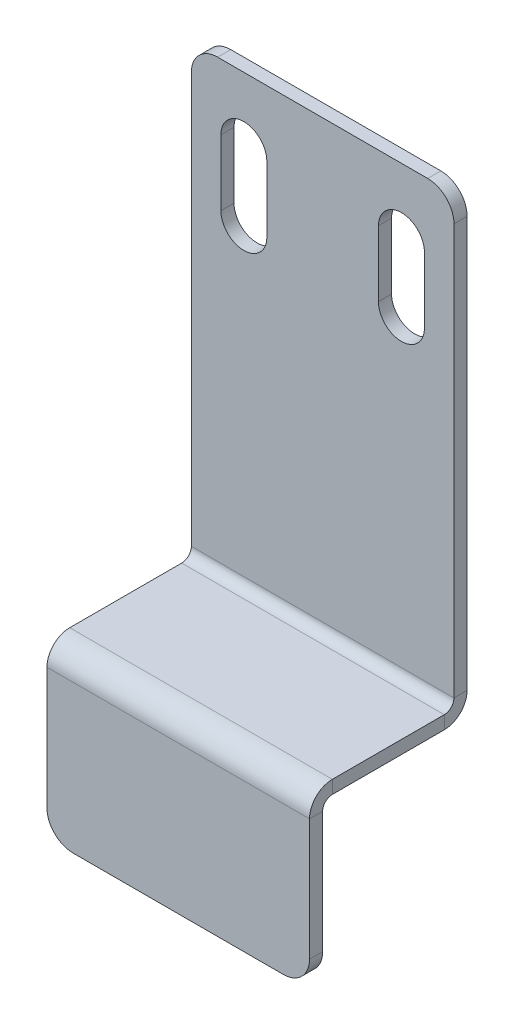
ISO-10303-21;
HEADER;
FILE_DESCRIPTION(('STEP AP214'),'2;1');
FILE_NAME('part.step','',(''),(''),'','','');
FILE_SCHEMA(('AUTOMOTIVE_DESIGN { 1 0 10303 214 1 1 1 1 }'));
ENDSEC;
DATA;
#1=APPLICATION_CONTEXT('core data for automotive mechanical design processes');
#2=APPLICATION_PROTOCOL_DEFINITION('international standard','automotive_design',2000,#1);
#3=PRODUCT_CONTEXT('',#1,'mechanical');
#4=PRODUCT('Part','Part','',(#3));
#5=PRODUCT_RELATED_PRODUCT_CATEGORY('part','',(#4));
#6=PRODUCT_DEFINITION_FORMATION('','',#4);
#7=PRODUCT_DEFINITION_CONTEXT('part definition',#1,'design');
#8=PRODUCT_DEFINITION('design','',#6,#7);
#9=PRODUCT_DEFINITION_SHAPE('','',#8);
#10=(LENGTH_UNIT() NAMED_UNIT(*) SI_UNIT(.MILLI.,.METRE.));
#11=(NAMED_UNIT(*) PLANE_ANGLE_UNIT() SI_UNIT($,.RADIAN.));
#12=(NAMED_UNIT(*) SI_UNIT($,.STERADIAN.) SOLID_ANGLE_UNIT());
#13=UNCERTAINTY_MEASURE_WITH_UNIT(LENGTH_MEASURE(1.E-05),#10,'distance_accuracy_value','');
#14=(GEOMETRIC_REPRESENTATION_CONTEXT(3) GLOBAL_UNCERTAINTY_ASSIGNED_CONTEXT((#13)) GLOBAL_UNIT_ASSIGNED_CONTEXT((#10,
#11,#12)) REPRESENTATION_CONTEXT('',''));
#15=CARTESIAN_POINT('',(0.,0.,0.));
#16=DIRECTION('',(0.,0.,1.));
#17=DIRECTION('',(1.,0.,0.));
#18=AXIS2_PLACEMENT_3D('',#15,#16,#17);
#19=CARTESIAN_POINT('',(20.,-35.,1.7366));
#20=DIRECTION('',(1.,0.,0.));
#21=DIRECTION('',(0.,0.,-1.));
#22=AXIS2_PLACEMENT_3D('',#19,#20,#21);
#23=PLANE('',#22);
#24=DIRECTION('',(0.,1.,0.));
#25=VECTOR('',#24,1.);
#26=CARTESIAN_POINT('',(20.,-35.,1.7366));
#27=LINE('',#26,#25);
#28=CARTESIAN_POINT('',(20.,-35.,1.7366));
#29=VERTEX_POINT('',#28);
#30=CARTESIAN_POINT('',(20.,-34.,1.7366));
#31=VERTEX_POINT('',#30);
#32=EDGE_CURVE('E374',#29,#31,#27,.T.);
#33=ORIENTED_EDGE('',*,*,#32,.F.);
#34=CARTESIAN_POINT('',(20.,-33.2634,1.7366));
#35=DIRECTION('',(1.,0.,0.));
#36=DIRECTION('',(0.,0.,-1.));
#37=AXIS2_PLACEMENT_3D('',#34,#35,#36);
#38=CIRCLE('',#37,1.7366);
#39=CARTESIAN_POINT('',(20.,-33.2634,0.));
#40=VERTEX_POINT('',#39);
#41=EDGE_CURVE('E280',#40,#29,#38,.F.);
#42=ORIENTED_EDGE('',*,*,#41,.F.);
#43=DIRECTION('',(0.,0.,-1.));
#44=VECTOR('',#43,1.);
#45=CARTESIAN_POINT('',(20.,-33.2634,0.999999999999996));
#46=LINE('',#45,#44);
#47=CARTESIAN_POINT('',(20.,-33.2634,0.999999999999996));
#48=VERTEX_POINT('',#47);
#49=EDGE_CURVE('E371',#48,#40,#46,.T.);
#50=ORIENTED_EDGE('',*,*,#49,.F.);
#51=CARTESIAN_POINT('',(20.,-33.2634,1.7366));
#52=DIRECTION('',(1.,0.,0.));
#53=DIRECTION('',(0.,0.,-1.));
#54=AXIS2_PLACEMENT_3D('',#51,#52,#53);
#55=CIRCLE('',#54,0.7366);
#56=EDGE_CURVE('E287',#48,#31,#55,.F.);
#57=ORIENTED_EDGE('',*,*,#56,.T.);
#58=EDGE_LOOP('',(#33,#42,#50,#57));
#59=FACE_BOUND('',#58,.T.);
#60=ADVANCED_FACE('F37',(#59),#23,.T.);
#61=CARTESIAN_POINT('',(20.,-33.2634,0.999999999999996));
#62=DIRECTION('',(1.,0.,0.));
#63=DIRECTION('',(0.,0.,-1.));
#64=AXIS2_PLACEMENT_3D('',#61,#62,#63);
#65=PLANE('',#64);
#66=DIRECTION('',(0.,0.,1.));
#67=VECTOR('',#66,1.);
#68=CARTESIAN_POINT('',(20.,-35.,0.));
#69=LINE('',#68,#67);
#70=CARTESIAN_POINT('',(20.,-35.,10.2634));
#71=VERTEX_POINT('',#70);
#72=EDGE_CURVE('E277',#29,#71,#69,.T.);
#73=ORIENTED_EDGE('',*,*,#72,.F.);
#74=ORIENTED_EDGE('',*,*,#32,.T.);
#75=DIRECTION('',(0.,0.,-1.));
#76=VECTOR('',#75,1.);
#77=CARTESIAN_POINT('',(20.,-34.,0.));
#78=LINE('',#77,#76);
#79=CARTESIAN_POINT('',(20.,-34.,10.2634));
#80=VERTEX_POINT('',#79);
#81=EDGE_CURVE('E290',#31,#80,#78,.F.);
#82=ORIENTED_EDGE('',*,*,#81,.T.);
#83=DIRECTION('',(0.,-1.,0.));
#84=VECTOR('',#83,1.);
#85=CARTESIAN_POINT('',(20.,-34.,10.2634));
#86=LINE('',#85,#84);
#87=EDGE_CURVE('E362',#80,#71,#86,.T.);
#88=ORIENTED_EDGE('',*,*,#87,.T.);
#89=EDGE_LOOP('',(#73,#74,#82,#88));
#90=FACE_BOUND('',#89,.T.);
#91=ADVANCED_FACE('F441',(#90),#65,.T.);
#92=CARTESIAN_POINT('',(0.,-33.2634,0.));
#93=DIRECTION('',(-1.,0.,0.));
#94=DIRECTION('',(0.,0.,1.));
#95=AXIS2_PLACEMENT_3D('',#92,#93,#94);
#96=PLANE('',#95);
#97=DIRECTION('',(0.,0.,1.));
#98=VECTOR('',#97,1.);
#99=CARTESIAN_POINT('',(0.,-33.2634,0.));
#100=LINE('',#99,#98);
#101=CARTESIAN_POINT('',(0.,-33.2634,0.));
#102=VERTEX_POINT('',#101);
#103=CARTESIAN_POINT('',(0.,-33.2634,0.999999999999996));
#104=VERTEX_POINT('',#103);
#105=EDGE_CURVE('E368',#102,#104,#100,.T.);
#106=ORIENTED_EDGE('',*,*,#105,.F.);
#107=CARTESIAN_POINT('',(0.,-33.2634,1.7366));
#108=DIRECTION('',(1.,0.,0.));
#109=DIRECTION('',(0.,0.,-1.));
#110=AXIS2_PLACEMENT_3D('',#107,#108,#109);
#111=CIRCLE('',#110,1.7366);
#112=CARTESIAN_POINT('',(0.,-35.,1.7366));
#113=VERTEX_POINT('',#112);
#114=EDGE_CURVE('E308',#102,#113,#111,.F.);
#115=ORIENTED_EDGE('',*,*,#114,.T.);
#116=DIRECTION('',(0.,-1.,0.));
#117=VECTOR('',#116,1.);
#118=CARTESIAN_POINT('',(0.,-34.,1.7366));
#119=LINE('',#118,#117);
#120=CARTESIAN_POINT('',(0.,-34.,1.7366));
#121=VERTEX_POINT('',#120);
#122=EDGE_CURVE('E366',#121,#113,#119,.T.);
#123=ORIENTED_EDGE('',*,*,#122,.F.);
#124=CARTESIAN_POINT('',(0.,-33.2634,1.7366));
#125=DIRECTION('',(1.,0.,0.));
#126=DIRECTION('',(0.,0.,-1.));
#127=AXIS2_PLACEMENT_3D('',#124,#125,#126);
#128=CIRCLE('',#127,0.7366);
#129=EDGE_CURVE('E315',#104,#121,#128,.F.);
#130=ORIENTED_EDGE('',*,*,#129,.F.);
#131=EDGE_LOOP('',(#106,#115,#123,#130));
#132=FACE_BOUND('',#131,.T.);
#133=ADVANCED_FACE('F500',(#132),#96,.T.);
#134=CARTESIAN_POINT('',(0.,-34.,1.7366));
#135=DIRECTION('',(-1.,0.,0.));
#136=DIRECTION('',(0.,0.,1.));
#137=AXIS2_PLACEMENT_3D('',#134,#135,#136);
#138=PLANE('',#137);
#139=DIRECTION('',(0.,-1.,0.));
#140=VECTOR('',#139,1.);
#141=CARTESIAN_POINT('',(0.,0.,1.));
#142=LINE('',#141,#140);
#143=CARTESIAN_POINT('',(0.,-2.,1.));
#144=VERTEX_POINT('',#143);
#145=EDGE_CURVE('E313',#144,#104,#142,.T.);
#146=ORIENTED_EDGE('',*,*,#145,.F.);
#147=DIRECTION('',(0.,0.,-1.));
#148=VECTOR('',#147,1.);
#149=CARTESIAN_POINT('',(0.,-2.,1.7366));
#150=LINE('',#149,#148);
#151=CARTESIAN_POINT('',(0.,-2.,0.));
#152=VERTEX_POINT('',#151);
#153=EDGE_CURVE('E11',#144,#152,#150,.T.);
#154=ORIENTED_EDGE('',*,*,#153,.T.);
#155=DIRECTION('',(0.,-1.,0.));
#156=VECTOR('',#155,1.);
#157=CARTESIAN_POINT('',(0.,0.,0.));
#158=LINE('',#157,#156);
#159=EDGE_CURVE('E311',#152,#102,#158,.T.);
#160=ORIENTED_EDGE('',*,*,#159,.T.);
#161=ORIENTED_EDGE('',*,*,#105,.T.);
#162=EDGE_LOOP('',(#146,#154,#160,#161));
#163=FACE_BOUND('',#162,.T.);
#164=ADVANCED_FACE('F522',(#163),#138,.T.);
#165=CARTESIAN_POINT('',(20.,-35.7366,11.));
#166=DIRECTION('',(1.,0.,0.));
#167=DIRECTION('',(0.,0.,-1.));
#168=AXIS2_PLACEMENT_3D('',#165,#166,#167);
#169=PLANE('',#168);
#170=DIRECTION('',(0.,0.,1.));
#171=VECTOR('',#170,1.);
#172=CARTESIAN_POINT('',(20.,-35.7366,11.));
#173=LINE('',#172,#171);
#174=CARTESIAN_POINT('',(20.,-35.7366,11.));
#175=VERTEX_POINT('',#174);
#176=CARTESIAN_POINT('',(20.,-35.7366,12.));
#177=VERTEX_POINT('',#176);
#178=EDGE_CURVE('E364',#175,#177,#173,.T.);
#179=ORIENTED_EDGE('',*,*,#178,.F.);
#180=CARTESIAN_POINT('',(20.,-35.7366,10.2634));
#181=DIRECTION('',(-1.,0.,0.));
#182=DIRECTION('',(0.,0.,1.));
#183=AXIS2_PLACEMENT_3D('',#180,#181,#182);
#184=CIRCLE('',#183,0.7366);
#185=EDGE_CURVE('E274',#71,#175,#184,.F.);
#186=ORIENTED_EDGE('',*,*,#185,.F.);
#187=ORIENTED_EDGE('',*,*,#87,.F.);
#188=CARTESIAN_POINT('',(20.,-35.7366,10.2634));
#189=DIRECTION('',(1.,0.,0.));
#190=DIRECTION('',(0.,0.,-1.));
#191=AXIS2_PLACEMENT_3D('',#188,#189,#190);
#192=CIRCLE('',#191,1.7366);
#193=EDGE_CURVE('E293',#80,#177,#192,.T.);
#194=ORIENTED_EDGE('',*,*,#193,.T.);
#195=EDGE_LOOP('',(#179,#186,#187,#194));
#196=FACE_BOUND('',#195,.T.);
#197=ADVANCED_FACE('F450',(#196),#169,.T.);
#198=CARTESIAN_POINT('',(20.,-34.,10.2634));
#199=DIRECTION('',(1.,0.,0.));
#200=DIRECTION('',(0.,0.,-1.));
#201=AXIS2_PLACEMENT_3D('',#198,#199,#200);
#202=PLANE('',#201);
#203=DIRECTION('',(0.,-1.,0.));
#204=VECTOR('',#203,1.);
#205=CARTESIAN_POINT('',(20.,-35.,12.));
#206=LINE('',#205,#204);
#207=CARTESIAN_POINT('',(20.,-45.,12.));
#208=VERTEX_POINT('',#207);
#209=EDGE_CURVE('E267',#177,#208,#206,.T.);
#210=ORIENTED_EDGE('',*,*,#209,.T.);
#211=DIRECTION('',(0.,0.,1.));
#212=VECTOR('',#211,1.);
#213=CARTESIAN_POINT('',(20.,-45.,10.2634));
#214=LINE('',#213,#212);
#215=CARTESIAN_POINT('',(20.,-45.,11.));
#216=VERTEX_POINT('',#215);
#217=EDGE_CURVE('E392',#208,#216,#214,.F.);
#218=ORIENTED_EDGE('',*,*,#217,.T.);
#219=DIRECTION('',(0.,-1.,0.));
#220=VECTOR('',#219,1.);
#221=CARTESIAN_POINT('',(20.,-35.,11.));
#222=LINE('',#221,#220);
#223=EDGE_CURVE('E270',#175,#216,#222,.T.);
#224=ORIENTED_EDGE('',*,*,#223,.F.);
#225=ORIENTED_EDGE('',*,*,#178,.T.);
#226=EDGE_LOOP('',(#210,#218,#224,#225));
#227=FACE_BOUND('',#226,.T.);
#228=ADVANCED_FACE('F460',(#227),#202,.T.);
#229=CARTESIAN_POINT('',(0.,-35.,10.2634));
#230=DIRECTION('',(-1.,0.,0.));
#231=DIRECTION('',(0.,0.,1.));
#232=AXIS2_PLACEMENT_3D('',#229,#230,#231);
#233=PLANE('',#232);
#234=DIRECTION('',(0.,1.,0.));
#235=VECTOR('',#234,1.);
#236=CARTESIAN_POINT('',(0.,-35.,10.2634));
#237=LINE('',#236,#235);
#238=CARTESIAN_POINT('',(0.,-35.,10.2634));
#239=VERTEX_POINT('',#238);
#240=CARTESIAN_POINT('',(0.,-34.,10.2634));
#241=VERTEX_POINT('',#240);
#242=EDGE_CURVE('E360',#239,#241,#237,.T.);
#243=ORIENTED_EDGE('',*,*,#242,.F.);
#244=CARTESIAN_POINT('',(0.,-35.7366,10.2634));
#245=DIRECTION('',(-1.,0.,0.));
#246=DIRECTION('',(0.,0.,1.));
#247=AXIS2_PLACEMENT_3D('',#244,#245,#246);
#248=CIRCLE('',#247,0.7366);
#249=CARTESIAN_POINT('',(0.,-35.7366,11.));
#250=VERTEX_POINT('',#249);
#251=EDGE_CURVE('E302',#239,#250,#248,.F.);
#252=ORIENTED_EDGE('',*,*,#251,.T.);
#253=DIRECTION('',(0.,0.,-1.));
#254=VECTOR('',#253,1.);
#255=CARTESIAN_POINT('',(0.,-35.7366,12.));
#256=LINE('',#255,#254);
#257=CARTESIAN_POINT('',(0.,-35.7366,12.));
#258=VERTEX_POINT('',#257);
#259=EDGE_CURVE('E358',#258,#250,#256,.T.);
#260=ORIENTED_EDGE('',*,*,#259,.F.);
#261=CARTESIAN_POINT('',(0.,-35.7366,10.2634));
#262=DIRECTION('',(1.,0.,0.));
#263=DIRECTION('',(0.,0.,-1.));
#264=AXIS2_PLACEMENT_3D('',#261,#262,#263);
#265=CIRCLE('',#264,1.7366);
#266=EDGE_CURVE('E271',#241,#258,#265,.T.);
#267=ORIENTED_EDGE('',*,*,#266,.F.);
#268=EDGE_LOOP('',(#243,#252,#260,#267));
#269=FACE_BOUND('',#268,.T.);
#270=ADVANCED_FACE('F480',(#269),#233,.T.);
#271=CARTESIAN_POINT('',(0.,-35.7366,12.));
#272=DIRECTION('',(-1.,0.,0.));
#273=DIRECTION('',(0.,0.,1.));
#274=AXIS2_PLACEMENT_3D('',#271,#272,#273);
#275=PLANE('',#274);
#276=DIRECTION('',(0.,0.,1.));
#277=VECTOR('',#276,1.);
#278=CARTESIAN_POINT('',(0.,-35.,0.));
#279=LINE('',#278,#277);
#280=EDGE_CURVE('E305',#113,#239,#279,.T.);
#281=ORIENTED_EDGE('',*,*,#280,.T.);
#282=ORIENTED_EDGE('',*,*,#242,.T.);
#283=DIRECTION('',(0.,0.,-1.));
#284=VECTOR('',#283,1.);
#285=CARTESIAN_POINT('',(0.,-34.,0.));
#286=LINE('',#285,#284);
#287=EDGE_CURVE('E318',#121,#241,#286,.F.);
#288=ORIENTED_EDGE('',*,*,#287,.F.);
#289=ORIENTED_EDGE('',*,*,#122,.T.);
#290=EDGE_LOOP('',(#281,#282,#288,#289));
#291=FACE_BOUND('',#290,.T.);
#292=ADVANCED_FACE('F486',(#291),#275,.T.);
#293=CARTESIAN_POINT('',(20.,-35.,12.));
#294=DIRECTION('',(0.,0.,-1.));
#295=DIRECTION('',(0.,1.,0.));
#296=AXIS2_PLACEMENT_3D('',#293,#294,#295);
#297=PLANE('',#296);
#298=DIRECTION('',(0.,-1.,0.));
#299=VECTOR('',#298,1.);
#300=CARTESIAN_POINT('',(0.,-35.,12.));
#301=LINE('',#300,#299);
#302=CARTESIAN_POINT('',(0.,-45.,12.));
#303=VERTEX_POINT('',#302);
#304=EDGE_CURVE('E260',#258,#303,#301,.T.);
#305=ORIENTED_EDGE('',*,*,#304,.T.);
#306=CARTESIAN_POINT('',(2.,-45.,12.));
#307=DIRECTION('',(0.,0.,-1.));
#308=DIRECTION('',(0.,1.,0.));
#309=AXIS2_PLACEMENT_3D('',#306,#307,#308);
#310=CIRCLE('',#309,2.);
#311=CARTESIAN_POINT('',(2.,-47.,12.));
#312=VERTEX_POINT('',#311);
#313=EDGE_CURVE('E381',#303,#312,#310,.F.);
#314=ORIENTED_EDGE('',*,*,#313,.T.);
#315=DIRECTION('',(-1.,0.,0.));
#316=VECTOR('',#315,1.);
#317=CARTESIAN_POINT('',(20.,-47.,12.));
#318=LINE('',#317,#316);
#319=CARTESIAN_POINT('',(18.,-47.,12.));
#320=VERTEX_POINT('',#319);
#321=EDGE_CURVE('E355',#320,#312,#318,.T.);
#322=ORIENTED_EDGE('',*,*,#321,.F.);
#323=CARTESIAN_POINT('',(18.,-45.,12.));
#324=DIRECTION('',(0.,0.,-1.));
#325=DIRECTION('',(0.,1.,0.));
#326=AXIS2_PLACEMENT_3D('',#323,#324,#325);
#327=CIRCLE('',#326,2.);
#328=EDGE_CURVE('E379',#320,#208,#327,.F.);
#329=ORIENTED_EDGE('',*,*,#328,.T.);
#330=ORIENTED_EDGE('',*,*,#209,.F.);
#331=DIRECTION('',(-1.,0.,0.));
#332=VECTOR('',#331,1.);
#333=CARTESIAN_POINT('',(20.,-35.7366,12.));
#334=LINE('',#333,#332);
#335=EDGE_CURVE('E296',#177,#258,#334,.T.);
#336=ORIENTED_EDGE('',*,*,#335,.T.);
#337=EDGE_LOOP('',(#305,#314,#322,#329,#330,#336));
#338=FACE_BOUND('',#337,.T.);
#339=ADVANCED_FACE('F484',(#338),#297,.F.);
#340=CARTESIAN_POINT('',(20.,-47.,11.));
#341=DIRECTION('',(0.,-1.,0.));
#342=DIRECTION('',(0.,0.,-1.));
#343=AXIS2_PLACEMENT_3D('',#340,#341,#342);
#344=PLANE('',#343);
#345=ORIENTED_EDGE('',*,*,#321,.T.);
#346=DIRECTION('',(0.,0.,1.));
#347=VECTOR('',#346,1.);
#348=CARTESIAN_POINT('',(2.,-47.,11.));
#349=LINE('',#348,#347);
#350=CARTESIAN_POINT('',(2.,-47.,11.));
#351=VERTEX_POINT('',#350);
#352=EDGE_CURVE('E386',#312,#351,#349,.F.);
#353=ORIENTED_EDGE('',*,*,#352,.T.);
#354=DIRECTION('',(-1.,0.,0.));
#355=VECTOR('',#354,1.);
#356=CARTESIAN_POINT('',(20.,-47.,11.));
#357=LINE('',#356,#355);
#358=CARTESIAN_POINT('',(18.,-47.,11.));
#359=VERTEX_POINT('',#358);
#360=EDGE_CURVE('E352',#359,#351,#357,.T.);
#361=ORIENTED_EDGE('',*,*,#360,.F.);
#362=DIRECTION('',(0.,0.,1.));
#363=VECTOR('',#362,1.);
#364=CARTESIAN_POINT('',(18.,-47.,11.));
#365=LINE('',#364,#363);
#366=EDGE_CURVE('E383',#359,#320,#365,.T.);
#367=ORIENTED_EDGE('',*,*,#366,.T.);
#368=EDGE_LOOP('',(#345,#353,#361,#367));
#369=FACE_BOUND('',#368,.T.);
#370=ADVANCED_FACE('F469',(#369),#344,.T.);
#371=CARTESIAN_POINT('',(20.,-35.,11.));
#372=DIRECTION('',(0.,0.,-1.));
#373=DIRECTION('',(0.,1.,0.));
#374=AXIS2_PLACEMENT_3D('',#371,#372,#373);
#375=PLANE('',#374);
#376=ORIENTED_EDGE('',*,*,#360,.T.);
#377=CARTESIAN_POINT('',(2.,-45.,11.));
#378=DIRECTION('',(0.,0.,-1.));
#379=DIRECTION('',(0.,1.,0.));
#380=AXIS2_PLACEMENT_3D('',#377,#378,#379);
#381=CIRCLE('',#380,2.);
#382=CARTESIAN_POINT('',(0.,-45.,11.));
#383=VERTEX_POINT('',#382);
#384=EDGE_CURVE('E390',#351,#383,#381,.T.);
#385=ORIENTED_EDGE('',*,*,#384,.T.);
#386=DIRECTION('',(0.,-1.,0.));
#387=VECTOR('',#386,1.);
#388=CARTESIAN_POINT('',(0.,-35.,11.));
#389=LINE('',#388,#387);
#390=EDGE_CURVE('E299',#250,#383,#389,.T.);
#391=ORIENTED_EDGE('',*,*,#390,.F.);
#392=DIRECTION('',(-1.,0.,0.));
#393=VECTOR('',#392,1.);
#394=CARTESIAN_POINT('',(20.,-35.7366,11.));
#395=LINE('',#394,#393);
#396=EDGE_CURVE('E349',#175,#250,#395,.T.);
#397=ORIENTED_EDGE('',*,*,#396,.F.);
#398=ORIENTED_EDGE('',*,*,#223,.T.);
#399=CARTESIAN_POINT('',(18.,-45.,11.));
#400=DIRECTION('',(0.,0.,-1.));
#401=DIRECTION('',(0.,1.,0.));
#402=AXIS2_PLACEMENT_3D('',#399,#400,#401);
#403=CIRCLE('',#402,2.);
#404=EDGE_CURVE('E388',#216,#359,#403,.T.);
#405=ORIENTED_EDGE('',*,*,#404,.T.);
#406=EDGE_LOOP('',(#376,#385,#391,#397,#398,#405));
#407=FACE_BOUND('',#406,.T.);
#408=ADVANCED_FACE('F458',(#407),#375,.T.);
#409=CARTESIAN_POINT('',(20.,-35.7366,10.2634));
#410=DIRECTION('',(-1.,0.,0.));
#411=DIRECTION('',(0.,0.,1.));
#412=AXIS2_PLACEMENT_3D('',#409,#410,#411);
#413=CYLINDRICAL_SURFACE('',#412,0.7366);
#414=ORIENTED_EDGE('',*,*,#251,.F.);
#415=DIRECTION('',(-1.,0.,0.));
#416=VECTOR('',#415,1.);
#417=CARTESIAN_POINT('',(20.,-35.,10.2634));
#418=LINE('',#417,#416);
#419=EDGE_CURVE('E346',#71,#239,#418,.T.);
#420=ORIENTED_EDGE('',*,*,#419,.F.);
#421=ORIENTED_EDGE('',*,*,#185,.T.);
#422=ORIENTED_EDGE('',*,*,#396,.T.);
#423=EDGE_LOOP('',(#414,#420,#421,#422));
#424=FACE_BOUND('',#423,.T.);
#425=ADVANCED_FACE('F449',(#424),#413,.F.);
#426=CARTESIAN_POINT('',(20.,-35.,0.));
#427=DIRECTION('',(0.,-1.,0.));
#428=DIRECTION('',(0.,0.,-1.));
#429=AXIS2_PLACEMENT_3D('',#426,#427,#428);
#430=PLANE('',#429);
#431=ORIENTED_EDGE('',*,*,#280,.F.);
#432=DIRECTION('',(-1.,0.,0.));
#433=VECTOR('',#432,1.);
#434=CARTESIAN_POINT('',(20.,-35.,1.7366));
#435=LINE('',#434,#433);
#436=EDGE_CURVE('E343',#29,#113,#435,.T.);
#437=ORIENTED_EDGE('',*,*,#436,.F.);
#438=ORIENTED_EDGE('',*,*,#72,.T.);
#439=ORIENTED_EDGE('',*,*,#419,.T.);
#440=EDGE_LOOP('',(#431,#437,#438,#439));
#441=FACE_BOUND('',#440,.T.);
#442=ADVANCED_FACE('F440',(#441),#430,.T.);
#443=CARTESIAN_POINT('',(20.,-33.2634,1.7366));
#444=DIRECTION('',(-1.,0.,0.));
#445=DIRECTION('',(0.,0.,1.));
#446=AXIS2_PLACEMENT_3D('',#443,#444,#445);
#447=CYLINDRICAL_SURFACE('',#446,1.7366);
#448=ORIENTED_EDGE('',*,*,#114,.F.);
#449=DIRECTION('',(-1.,0.,0.));
#450=VECTOR('',#449,1.);
#451=CARTESIAN_POINT('',(20.,-33.2634,0.));
#452=LINE('',#451,#450);
#453=EDGE_CURVE('E340',#40,#102,#452,.T.);
#454=ORIENTED_EDGE('',*,*,#453,.F.);
#455=ORIENTED_EDGE('',*,*,#41,.T.);
#456=ORIENTED_EDGE('',*,*,#436,.T.);
#457=EDGE_LOOP('',(#448,#454,#455,#456));
#458=FACE_BOUND('',#457,.T.);
#459=ADVANCED_FACE('F431',(#458),#447,.T.);
#460=CARTESIAN_POINT('',(20.,0.,0.));
#461=DIRECTION('',(0.,0.,-1.));
#462=DIRECTION('',(0.,1.,0.));
#463=AXIS2_PLACEMENT_3D('',#460,#461,#462);
#464=PLANE('',#463);
#465=CARTESIAN_POINT('',(16.,-5.,0.));
#466=DIRECTION('',(0.,0.,1.));
#467=DIRECTION('',(-1.,0.,0.));
#468=AXIS2_PLACEMENT_3D('',#465,#466,#467);
#469=CIRCLE('',#468,1.75);
#470=CARTESIAN_POINT('',(17.75,-5.,0.));
#471=VERTEX_POINT('',#470);
#472=CARTESIAN_POINT('',(14.25,-5.,0.));
#473=VERTEX_POINT('',#472);
#474=EDGE_CURVE('E200',#471,#473,#469,.T.);
#475=ORIENTED_EDGE('',*,*,#474,.T.);
#476=DIRECTION('',(0.,-1.,0.));
#477=VECTOR('',#476,1.);
#478=CARTESIAN_POINT('',(14.25,-5.,0.));
#479=LINE('',#478,#477);
#480=CARTESIAN_POINT('',(14.25,-10.,0.));
#481=VERTEX_POINT('',#480);
#482=EDGE_CURVE('E209',#473,#481,#479,.T.);
#483=ORIENTED_EDGE('',*,*,#482,.T.);
#484=CARTESIAN_POINT('',(16.,-10.,0.));
#485=DIRECTION('',(0.,0.,1.));
#486=DIRECTION('',(-1.,0.,0.));
#487=AXIS2_PLACEMENT_3D('',#484,#485,#486);
#488=CIRCLE('',#487,1.75);
#489=CARTESIAN_POINT('',(17.75,-10.,0.));
#490=VERTEX_POINT('',#489);
#491=EDGE_CURVE('E52',#481,#490,#488,.T.);
#492=ORIENTED_EDGE('',*,*,#491,.T.);
#493=DIRECTION('',(0.,1.,0.));
#494=VECTOR('',#493,1.);
#495=CARTESIAN_POINT('',(17.75,-5.,0.));
#496=LINE('',#495,#494);
#497=EDGE_CURVE('E206',#490,#471,#496,.T.);
#498=ORIENTED_EDGE('',*,*,#497,.T.);
#499=EDGE_LOOP('',(#475,#483,#492,#498));
#500=FACE_BOUND('',#499,.T.);
#501=CARTESIAN_POINT('',(4.,-5.,0.));
#502=DIRECTION('',(0.,0.,1.));
#503=DIRECTION('',(1.,0.,0.));
#504=AXIS2_PLACEMENT_3D('',#501,#502,#503);
#505=CIRCLE('',#504,1.75);
#506=CARTESIAN_POINT('',(5.75,-5.,0.));
#507=VERTEX_POINT('',#506);
#508=CARTESIAN_POINT('',(2.25,-5.,0.));
#509=VERTEX_POINT('',#508);
#510=EDGE_CURVE('E235',#507,#509,#505,.T.);
#511=ORIENTED_EDGE('',*,*,#510,.T.);
#512=DIRECTION('',(0.,-1.,0.));
#513=VECTOR('',#512,1.);
#514=CARTESIAN_POINT('',(2.25,-5.,0.));
#515=LINE('',#514,#513);
#516=CARTESIAN_POINT('',(2.25,-10.,0.));
#517=VERTEX_POINT('',#516);
#518=EDGE_CURVE('E238',#509,#517,#515,.T.);
#519=ORIENTED_EDGE('',*,*,#518,.T.);
#520=CARTESIAN_POINT('',(4.00000000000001,-10.,0.));
#521=DIRECTION('',(0.,0.,1.));
#522=DIRECTION('',(1.,0.,0.));
#523=AXIS2_PLACEMENT_3D('',#520,#521,#522);
#524=CIRCLE('',#523,1.75);
#525=CARTESIAN_POINT('',(5.75,-10.,0.));
#526=VERTEX_POINT('',#525);
#527=EDGE_CURVE('E242',#517,#526,#524,.T.);
#528=ORIENTED_EDGE('',*,*,#527,.T.);
#529=DIRECTION('',(0.,1.,0.));
#530=VECTOR('',#529,1.);
#531=CARTESIAN_POINT('',(5.75,-5.,0.));
#532=LINE('',#531,#530);
#533=EDGE_CURVE('E245',#526,#507,#532,.T.);
#534=ORIENTED_EDGE('',*,*,#533,.T.);
#535=EDGE_LOOP('',(#511,#519,#528,#534));
#536=FACE_BOUND('',#535,.T.);
#537=DIRECTION('',(-1.,0.,0.));
#538=VECTOR('',#537,1.);
#539=CARTESIAN_POINT('',(20.,0.,0.));
#540=LINE('',#539,#538);
#541=CARTESIAN_POINT('',(18.,0.,0.));
#542=VERTEX_POINT('',#541);
#543=CARTESIAN_POINT('',(2.,0.,0.));
#544=VERTEX_POINT('',#543);
#545=EDGE_CURVE('E337',#542,#544,#540,.T.);
#546=ORIENTED_EDGE('',*,*,#545,.F.);
#547=CARTESIAN_POINT('',(18.,-2.,0.));
#548=DIRECTION('',(0.,0.,-1.));
#549=DIRECTION('',(0.,1.,0.));
#550=AXIS2_PLACEMENT_3D('',#547,#548,#549);
#551=CIRCLE('',#550,2.);
#552=CARTESIAN_POINT('',(20.,-2.,0.));
#553=VERTEX_POINT('',#552);
#554=EDGE_CURVE('E401',#542,#553,#551,.T.);
#555=ORIENTED_EDGE('',*,*,#554,.T.);
#556=DIRECTION('',(0.,-1.,0.));
#557=VECTOR('',#556,1.);
#558=CARTESIAN_POINT('',(20.,0.,0.));
#559=LINE('',#558,#557);
#560=EDGE_CURVE('E283',#553,#40,#559,.T.);
#561=ORIENTED_EDGE('',*,*,#560,.T.);
#562=ORIENTED_EDGE('',*,*,#453,.T.);
#563=ORIENTED_EDGE('',*,*,#159,.F.);
#564=CARTESIAN_POINT('',(2.,-2.,0.));
#565=DIRECTION('',(0.,0.,-1.));
#566=DIRECTION('',(0.,1.,0.));
#567=AXIS2_PLACEMENT_3D('',#564,#565,#566);
#568=CIRCLE('',#567,2.);
#569=EDGE_CURVE('E399',#152,#544,#568,.T.);
#570=ORIENTED_EDGE('',*,*,#569,.T.);
#571=EDGE_LOOP('',(#546,#555,#561,#562,#563,#570));
#572=FACE_BOUND('',#571,.T.);
#573=ADVANCED_FACE('F213',(#500,#536,#572),#464,.T.);
#574=CARTESIAN_POINT('',(20.,0.,1.));
#575=DIRECTION('',(0.,1.,0.));
#576=DIRECTION('',(0.,0.,1.));
#577=AXIS2_PLACEMENT_3D('',#574,#575,#576);
#578=PLANE('',#577);
#579=DIRECTION('',(-1.,0.,0.));
#580=VECTOR('',#579,1.);
#581=CARTESIAN_POINT('',(20.,0.,1.));
#582=LINE('',#581,#580);
#583=CARTESIAN_POINT('',(18.,0.,1.));
#584=VERTEX_POINT('',#583);
#585=CARTESIAN_POINT('',(2.,0.,1.));
#586=VERTEX_POINT('',#585);
#587=EDGE_CURVE('E334',#584,#586,#582,.T.);
#588=ORIENTED_EDGE('',*,*,#587,.F.);
#589=DIRECTION('',(0.,0.,-1.));
#590=VECTOR('',#589,1.);
#591=CARTESIAN_POINT('',(18.,0.,0.));
#592=LINE('',#591,#590);
#593=EDGE_CURVE('E396',#584,#542,#592,.T.);
#594=ORIENTED_EDGE('',*,*,#593,.T.);
#595=ORIENTED_EDGE('',*,*,#545,.T.);
#596=DIRECTION('',(0.,0.,-1.));
#597=VECTOR('',#596,1.);
#598=CARTESIAN_POINT('',(2.,0.,1.));
#599=LINE('',#598,#597);
#600=EDGE_CURVE('E394',#544,#586,#599,.F.);
#601=ORIENTED_EDGE('',*,*,#600,.T.);
#602=EDGE_LOOP('',(#588,#594,#595,#601));
#603=FACE_BOUND('',#602,.T.);
#604=ADVANCED_FACE('F417',(#603),#578,.T.);
#605=CARTESIAN_POINT('',(20.,0.,1.));
#606=DIRECTION('',(0.,0.,-1.));
#607=DIRECTION('',(0.,1.,0.));
#608=AXIS2_PLACEMENT_3D('',#605,#606,#607);
#609=PLANE('',#608);
#610=DIRECTION('',(0.,-1.,0.));
#611=VECTOR('',#610,1.);
#612=CARTESIAN_POINT('',(14.25,-5.,1.));
#613=LINE('',#612,#611);
#614=CARTESIAN_POINT('',(14.25,-5.,0.999999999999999));
#615=VERTEX_POINT('',#614);
#616=CARTESIAN_POINT('',(14.25,-10.,1.));
#617=VERTEX_POINT('',#616);
#618=EDGE_CURVE('E225',#615,#617,#613,.T.);
#619=ORIENTED_EDGE('',*,*,#618,.F.);
#620=CARTESIAN_POINT('',(16.,-5.,1.));
#621=DIRECTION('',(0.,0.,1.));
#622=DIRECTION('',(-1.,0.,0.));
#623=AXIS2_PLACEMENT_3D('',#620,#621,#622);
#624=CIRCLE('',#623,1.75);
#625=CARTESIAN_POINT('',(17.75,-5.,1.));
#626=VERTEX_POINT('',#625);
#627=EDGE_CURVE('E60',#626,#615,#624,.T.);
#628=ORIENTED_EDGE('',*,*,#627,.F.);
#629=DIRECTION('',(0.,1.,0.));
#630=VECTOR('',#629,1.);
#631=CARTESIAN_POINT('',(17.75,-5.,1.));
#632=LINE('',#631,#630);
#633=CARTESIAN_POINT('',(17.75,-10.,1.));
#634=VERTEX_POINT('',#633);
#635=EDGE_CURVE('E216',#634,#626,#632,.T.);
#636=ORIENTED_EDGE('',*,*,#635,.F.);
#637=CARTESIAN_POINT('',(16.,-10.,1.));
#638=DIRECTION('',(0.,0.,1.));
#639=DIRECTION('',(-1.,0.,0.));
#640=AXIS2_PLACEMENT_3D('',#637,#638,#639);
#641=CIRCLE('',#640,1.75);
#642=EDGE_CURVE('E219',#617,#634,#641,.T.);
#643=ORIENTED_EDGE('',*,*,#642,.F.);
#644=EDGE_LOOP('',(#619,#628,#636,#643));
#645=FACE_BOUND('',#644,.T.);
#646=DIRECTION('',(0.,-1.,0.));
#647=VECTOR('',#646,1.);
#648=CARTESIAN_POINT('',(2.25,-5.,1.));
#649=LINE('',#648,#647);
#650=CARTESIAN_POINT('',(2.25,-5.,0.999999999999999));
#651=VERTEX_POINT('',#650);
#652=CARTESIAN_POINT('',(2.25,-10.,1.));
#653=VERTEX_POINT('',#652);
#654=EDGE_CURVE('E250',#651,#653,#649,.T.);
#655=ORIENTED_EDGE('',*,*,#654,.F.);
#656=CARTESIAN_POINT('',(4.,-5.,1.));
#657=DIRECTION('',(0.,0.,1.));
#658=DIRECTION('',(1.,0.,0.));
#659=AXIS2_PLACEMENT_3D('',#656,#657,#658);
#660=CIRCLE('',#659,1.75);
#661=CARTESIAN_POINT('',(5.75,-5.,1.));
#662=VERTEX_POINT('',#661);
#663=EDGE_CURVE('E231',#662,#651,#660,.T.);
#664=ORIENTED_EDGE('',*,*,#663,.F.);
#665=DIRECTION('',(0.,1.,0.));
#666=VECTOR('',#665,1.);
#667=CARTESIAN_POINT('',(5.75,-5.,1.));
#668=LINE('',#667,#666);
#669=CARTESIAN_POINT('',(5.75,-10.,1.));
#670=VERTEX_POINT('',#669);
#671=EDGE_CURVE('E239',#670,#662,#668,.T.);
#672=ORIENTED_EDGE('',*,*,#671,.F.);
#673=CARTESIAN_POINT('',(4.00000000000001,-10.,1.));
#674=DIRECTION('',(0.,0.,1.));
#675=DIRECTION('',(1.,0.,0.));
#676=AXIS2_PLACEMENT_3D('',#673,#674,#675);
#677=CIRCLE('',#676,1.75);
#678=EDGE_CURVE('E253',#653,#670,#677,.T.);
#679=ORIENTED_EDGE('',*,*,#678,.F.);
#680=EDGE_LOOP('',(#655,#664,#672,#679));
#681=FACE_BOUND('',#680,.T.);
#682=DIRECTION('',(0.,-1.,0.));
#683=VECTOR('',#682,1.);
#684=CARTESIAN_POINT('',(20.,0.,1.));
#685=LINE('',#684,#683);
#686=CARTESIAN_POINT('',(20.,-2.,1.));
#687=VERTEX_POINT('',#686);
#688=EDGE_CURVE('E285',#687,#48,#685,.T.);
#689=ORIENTED_EDGE('',*,*,#688,.F.);
#690=CARTESIAN_POINT('',(18.,-2.,1.));
#691=DIRECTION('',(0.,0.,-1.));
#692=DIRECTION('',(0.,1.,0.));
#693=AXIS2_PLACEMENT_3D('',#690,#691,#692);
#694=CIRCLE('',#693,2.);
#695=EDGE_CURVE('E45',#687,#584,#694,.F.);
#696=ORIENTED_EDGE('',*,*,#695,.T.);
#697=ORIENTED_EDGE('',*,*,#587,.T.);
#698=CARTESIAN_POINT('',(2.,-2.,1.));
#699=DIRECTION('',(0.,0.,-1.));
#700=DIRECTION('',(0.,1.,0.));
#701=AXIS2_PLACEMENT_3D('',#698,#699,#700);
#702=CIRCLE('',#701,2.);
#703=EDGE_CURVE('E405',#586,#144,#702,.F.);
#704=ORIENTED_EDGE('',*,*,#703,.T.);
#705=ORIENTED_EDGE('',*,*,#145,.T.);
#706=DIRECTION('',(-1.,0.,0.));
#707=VECTOR('',#706,1.);
#708=CARTESIAN_POINT('',(20.,-33.2634,0.999999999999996));
#709=LINE('',#708,#707);
#710=EDGE_CURVE('E331',#48,#104,#709,.T.);
#711=ORIENTED_EDGE('',*,*,#710,.F.);
#712=EDGE_LOOP('',(#689,#696,#697,#704,#705,#711));
#713=FACE_BOUND('',#712,.T.);
#714=ADVANCED_FACE('F410',(#645,#681,#713),#609,.F.);
#715=CARTESIAN_POINT('',(20.,-33.2634,1.7366));
#716=DIRECTION('',(-1.,0.,0.));
#717=DIRECTION('',(0.,0.,1.));
#718=AXIS2_PLACEMENT_3D('',#715,#716,#717);
#719=CYLINDRICAL_SURFACE('',#718,0.7366);
#720=ORIENTED_EDGE('',*,*,#129,.T.);
#721=DIRECTION('',(-1.,0.,0.));
#722=VECTOR('',#721,1.);
#723=CARTESIAN_POINT('',(20.,-34.,1.7366));
#724=LINE('',#723,#722);
#725=EDGE_CURVE('E328',#31,#121,#724,.T.);
#726=ORIENTED_EDGE('',*,*,#725,.F.);
#727=ORIENTED_EDGE('',*,*,#56,.F.);
#728=ORIENTED_EDGE('',*,*,#710,.T.);
#729=EDGE_LOOP('',(#720,#726,#727,#728));
#730=FACE_BOUND('',#729,.T.);
#731=ADVANCED_FACE('F527',(#730),#719,.F.);
#732=CARTESIAN_POINT('',(20.,-34.,0.));
#733=DIRECTION('',(0.,-1.,0.));
#734=DIRECTION('',(0.,0.,-1.));
#735=AXIS2_PLACEMENT_3D('',#732,#733,#734);
#736=PLANE('',#735);
#737=ORIENTED_EDGE('',*,*,#287,.T.);
#738=DIRECTION('',(-1.,0.,0.));
#739=VECTOR('',#738,1.);
#740=CARTESIAN_POINT('',(20.,-34.,10.2634));
#741=LINE('',#740,#739);
#742=EDGE_CURVE('E325',#80,#241,#741,.T.);
#743=ORIENTED_EDGE('',*,*,#742,.F.);
#744=ORIENTED_EDGE('',*,*,#81,.F.);
#745=ORIENTED_EDGE('',*,*,#725,.T.);
#746=EDGE_LOOP('',(#737,#743,#744,#745));
#747=FACE_BOUND('',#746,.T.);
#748=ADVANCED_FACE('F530',(#747),#736,.F.);
#749=CARTESIAN_POINT('',(20.,-35.7366,10.2634));
#750=DIRECTION('',(-1.,0.,0.));
#751=DIRECTION('',(0.,0.,1.));
#752=AXIS2_PLACEMENT_3D('',#749,#750,#751);
#753=CYLINDRICAL_SURFACE('',#752,1.7366);
#754=ORIENTED_EDGE('',*,*,#266,.T.);
#755=ORIENTED_EDGE('',*,*,#335,.F.);
#756=ORIENTED_EDGE('',*,*,#193,.F.);
#757=ORIENTED_EDGE('',*,*,#742,.T.);
#758=EDGE_LOOP('',(#754,#755,#756,#757));
#759=FACE_BOUND('',#758,.T.);
#760=ADVANCED_FACE('F482',(#759),#753,.T.);
#761=CARTESIAN_POINT('',(20.,-35.7366,10.2634));
#762=DIRECTION('',(-1.,0.,0.));
#763=DIRECTION('',(0.,0.,1.));
#764=AXIS2_PLACEMENT_3D('',#761,#762,#763);
#765=PLANE('',#764);
#766=ORIENTED_EDGE('',*,*,#560,.F.);
#767=DIRECTION('',(0.,0.,-1.));
#768=VECTOR('',#767,1.);
#769=CARTESIAN_POINT('',(20.,-2.,1.));
#770=LINE('',#769,#768);
#771=EDGE_CURVE('E403',#553,#687,#770,.F.);
#772=ORIENTED_EDGE('',*,*,#771,.T.);
#773=ORIENTED_EDGE('',*,*,#688,.T.);
#774=ORIENTED_EDGE('',*,*,#49,.T.);
#775=EDGE_LOOP('',(#766,#772,#773,#774));
#776=FACE_BOUND('',#775,.T.);
#777=ADVANCED_FACE('F424',(#776),#765,.F.);
#778=CARTESIAN_POINT('',(0.,-35.7366,10.2634));
#779=DIRECTION('',(-1.,0.,0.));
#780=DIRECTION('',(0.,0.,1.));
#781=AXIS2_PLACEMENT_3D('',#778,#779,#780);
#782=PLANE('',#781);
#783=ORIENTED_EDGE('',*,*,#390,.T.);
#784=DIRECTION('',(0.,0.,1.));
#785=VECTOR('',#784,1.);
#786=CARTESIAN_POINT('',(0.,-45.,10.2634));
#787=LINE('',#786,#785);
#788=EDGE_CURVE('E376',#383,#303,#787,.T.);
#789=ORIENTED_EDGE('',*,*,#788,.T.);
#790=ORIENTED_EDGE('',*,*,#304,.F.);
#791=ORIENTED_EDGE('',*,*,#259,.T.);
#792=EDGE_LOOP('',(#783,#789,#790,#791));
#793=FACE_BOUND('',#792,.T.);
#794=ADVANCED_FACE('F476',(#793),#782,.T.);
#795=CARTESIAN_POINT('',(2.,-45.,10.2634));
#796=DIRECTION('',(0.,0.,1.));
#797=DIRECTION('',(1.,0.,0.));
#798=AXIS2_PLACEMENT_3D('',#795,#796,#797);
#799=CYLINDRICAL_SURFACE('',#798,2.);
#800=ORIENTED_EDGE('',*,*,#384,.F.);
#801=ORIENTED_EDGE('',*,*,#352,.F.);
#802=ORIENTED_EDGE('',*,*,#313,.F.);
#803=ORIENTED_EDGE('',*,*,#788,.F.);
#804=EDGE_LOOP('',(#800,#801,#802,#803));
#805=FACE_BOUND('',#804,.T.);
#806=ADVANCED_FACE('F473',(#805),#799,.T.);
#807=CARTESIAN_POINT('',(18.,-45.,11.));
#808=DIRECTION('',(0.,0.,1.));
#809=DIRECTION('',(1.,0.,0.));
#810=AXIS2_PLACEMENT_3D('',#807,#808,#809);
#811=CYLINDRICAL_SURFACE('',#810,2.);
#812=ORIENTED_EDGE('',*,*,#404,.F.);
#813=ORIENTED_EDGE('',*,*,#217,.F.);
#814=ORIENTED_EDGE('',*,*,#328,.F.);
#815=ORIENTED_EDGE('',*,*,#366,.F.);
#816=EDGE_LOOP('',(#812,#813,#814,#815));
#817=FACE_BOUND('',#816,.T.);
#818=ADVANCED_FACE('F464',(#817),#811,.T.);
#819=CARTESIAN_POINT('',(18.,-2.,1.));
#820=DIRECTION('',(0.,0.,1.));
#821=DIRECTION('',(0.,-1.,0.));
#822=AXIS2_PLACEMENT_3D('',#819,#820,#821);
#823=CYLINDRICAL_SURFACE('',#822,2.);
#824=ORIENTED_EDGE('',*,*,#695,.F.);
#825=ORIENTED_EDGE('',*,*,#771,.F.);
#826=ORIENTED_EDGE('',*,*,#554,.F.);
#827=ORIENTED_EDGE('',*,*,#593,.F.);
#828=EDGE_LOOP('',(#824,#825,#826,#827));
#829=FACE_BOUND('',#828,.T.);
#830=ADVANCED_FACE('F420',(#829),#823,.T.);
#831=CARTESIAN_POINT('',(2.,-2.,1.7366));
#832=DIRECTION('',(0.,0.,-1.));
#833=DIRECTION('',(0.,1.,0.));
#834=AXIS2_PLACEMENT_3D('',#831,#832,#833);
#835=CYLINDRICAL_SURFACE('',#834,2.);
#836=ORIENTED_EDGE('',*,*,#703,.F.);
#837=ORIENTED_EDGE('',*,*,#600,.F.);
#838=ORIENTED_EDGE('',*,*,#569,.F.);
#839=ORIENTED_EDGE('',*,*,#153,.F.);
#840=EDGE_LOOP('',(#836,#837,#838,#839));
#841=FACE_BOUND('',#840,.T.);
#842=ADVANCED_FACE('F39',(#841),#835,.T.);
#843=CARTESIAN_POINT('',(4.,-5.,0.));
#844=DIRECTION('',(0.,0.,1.));
#845=DIRECTION('',(1.,0.,0.));
#846=AXIS2_PLACEMENT_3D('',#843,#844,#845);
#847=CYLINDRICAL_SURFACE('',#846,1.75);
#848=ORIENTED_EDGE('',*,*,#663,.T.);
#849=DIRECTION('',(0.,0.,1.));
#850=VECTOR('',#849,1.);
#851=CARTESIAN_POINT('',(2.25,-5.,0.));
#852=LINE('',#851,#850);
#853=EDGE_CURVE('E248',#509,#651,#852,.T.);
#854=ORIENTED_EDGE('',*,*,#853,.F.);
#855=ORIENTED_EDGE('',*,*,#510,.F.);
#856=DIRECTION('',(0.,0.,1.));
#857=VECTOR('',#856,1.);
#858=CARTESIAN_POINT('',(5.75,-5.,0.));
#859=LINE('',#858,#857);
#860=EDGE_CURVE('E258',#507,#662,#859,.T.);
#861=ORIENTED_EDGE('',*,*,#860,.T.);
#862=EDGE_LOOP('',(#848,#854,#855,#861));
#863=FACE_BOUND('',#862,.T.);
#864=ADVANCED_FACE('F511',(#863),#847,.F.);
#865=CARTESIAN_POINT('',(5.75,-5.,0.));
#866=DIRECTION('',(1.,0.,0.));
#867=DIRECTION('',(0.,0.,-1.));
#868=AXIS2_PLACEMENT_3D('',#865,#866,#867);
#869=PLANE('',#868);
#870=ORIENTED_EDGE('',*,*,#671,.T.);
#871=ORIENTED_EDGE('',*,*,#860,.F.);
#872=ORIENTED_EDGE('',*,*,#533,.F.);
#873=DIRECTION('',(0.,0.,1.));
#874=VECTOR('',#873,1.);
#875=CARTESIAN_POINT('',(5.75,-10.,0.));
#876=LINE('',#875,#874);
#877=EDGE_CURVE('E261',#526,#670,#876,.T.);
#878=ORIENTED_EDGE('',*,*,#877,.T.);
#879=EDGE_LOOP('',(#870,#871,#872,#878));
#880=FACE_BOUND('',#879,.T.);
#881=ADVANCED_FACE('F516',(#880),#869,.F.);
#882=CARTESIAN_POINT('',(4.00000000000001,-10.,0.));
#883=DIRECTION('',(0.,0.,1.));
#884=DIRECTION('',(1.,0.,0.));
#885=AXIS2_PLACEMENT_3D('',#882,#883,#884);
#886=CYLINDRICAL_SURFACE('',#885,1.75);
#887=ORIENTED_EDGE('',*,*,#678,.T.);
#888=ORIENTED_EDGE('',*,*,#877,.F.);
#889=ORIENTED_EDGE('',*,*,#527,.F.);
#890=DIRECTION('',(0.,0.,1.));
#891=VECTOR('',#890,1.);
#892=CARTESIAN_POINT('',(2.25,-10.,0.));
#893=LINE('',#892,#891);
#894=EDGE_CURVE('E263',#517,#653,#893,.T.);
#895=ORIENTED_EDGE('',*,*,#894,.T.);
#896=EDGE_LOOP('',(#887,#888,#889,#895));
#897=FACE_BOUND('',#896,.T.);
#898=ADVANCED_FACE('F720',(#897),#886,.F.);
#899=CARTESIAN_POINT('',(2.25,-5.,0.));
#900=DIRECTION('',(-1.,0.,0.));
#901=DIRECTION('',(0.,0.,1.));
#902=AXIS2_PLACEMENT_3D('',#899,#900,#901);
#903=PLANE('',#902);
#904=ORIENTED_EDGE('',*,*,#654,.T.);
#905=ORIENTED_EDGE('',*,*,#894,.F.);
#906=ORIENTED_EDGE('',*,*,#518,.F.);
#907=ORIENTED_EDGE('',*,*,#853,.T.);
#908=EDGE_LOOP('',(#904,#905,#906,#907));
#909=FACE_BOUND('',#908,.T.);
#910=ADVANCED_FACE('F731',(#909),#903,.F.);
#911=CARTESIAN_POINT('',(16.,-5.,0.));
#912=DIRECTION('',(0.,0.,1.));
#913=DIRECTION('',(1.,0.,0.));
#914=AXIS2_PLACEMENT_3D('',#911,#912,#913);
#915=CYLINDRICAL_SURFACE('',#914,1.75);
#916=ORIENTED_EDGE('',*,*,#627,.T.);
#917=DIRECTION('',(0.,0.,1.));
#918=VECTOR('',#917,1.);
#919=CARTESIAN_POINT('',(14.25,-5.,0.));
#920=LINE('',#919,#918);
#921=EDGE_CURVE('E196',#473,#615,#920,.T.);
#922=ORIENTED_EDGE('',*,*,#921,.F.);
#923=ORIENTED_EDGE('',*,*,#474,.F.);
#924=DIRECTION('',(0.,0.,1.));
#925=VECTOR('',#924,1.);
#926=CARTESIAN_POINT('',(17.75,-5.,0.));
#927=LINE('',#926,#925);
#928=EDGE_CURVE('E229',#471,#626,#927,.T.);
#929=ORIENTED_EDGE('',*,*,#928,.T.);
#930=EDGE_LOOP('',(#916,#922,#923,#929));
#931=FACE_BOUND('',#930,.T.);
#932=ADVANCED_FACE('F198',(#931),#915,.F.);
#933=CARTESIAN_POINT('',(17.75,-5.,0.));
#934=DIRECTION('',(1.,0.,0.));
#935=DIRECTION('',(0.,0.,-1.));
#936=AXIS2_PLACEMENT_3D('',#933,#934,#935);
#937=PLANE('',#936);
#938=ORIENTED_EDGE('',*,*,#635,.T.);
#939=ORIENTED_EDGE('',*,*,#928,.F.);
#940=ORIENTED_EDGE('',*,*,#497,.F.);
#941=DIRECTION('',(0.,0.,1.));
#942=VECTOR('',#941,1.);
#943=CARTESIAN_POINT('',(17.75,-10.,0.));
#944=LINE('',#943,#942);
#945=EDGE_CURVE('E232',#490,#634,#944,.T.);
#946=ORIENTED_EDGE('',*,*,#945,.T.);
#947=EDGE_LOOP('',(#938,#939,#940,#946));
#948=FACE_BOUND('',#947,.T.);
#949=ADVANCED_FACE('F752',(#948),#937,.F.);
#950=CARTESIAN_POINT('',(16.,-10.,0.));
#951=DIRECTION('',(0.,0.,1.));
#952=DIRECTION('',(1.,0.,0.));
#953=AXIS2_PLACEMENT_3D('',#950,#951,#952);
#954=CYLINDRICAL_SURFACE('',#953,1.75);
#955=ORIENTED_EDGE('',*,*,#642,.T.);
#956=ORIENTED_EDGE('',*,*,#945,.F.);
#957=ORIENTED_EDGE('',*,*,#491,.F.);
#958=DIRECTION('',(0.,0.,1.));
#959=VECTOR('',#958,1.);
#960=CARTESIAN_POINT('',(14.25,-10.,0.));
#961=LINE('',#960,#959);
#962=EDGE_CURVE('E205',#481,#617,#961,.T.);
#963=ORIENTED_EDGE('',*,*,#962,.T.);
#964=EDGE_LOOP('',(#955,#956,#957,#963));
#965=FACE_BOUND('',#964,.T.);
#966=ADVANCED_FACE('F762',(#965),#954,.F.);
#967=CARTESIAN_POINT('',(14.25,-5.,0.));
#968=DIRECTION('',(-1.,0.,0.));
#969=DIRECTION('',(0.,0.,1.));
#970=AXIS2_PLACEMENT_3D('',#967,#968,#969);
#971=PLANE('',#970);
#972=ORIENTED_EDGE('',*,*,#618,.T.);
#973=ORIENTED_EDGE('',*,*,#962,.F.);
#974=ORIENTED_EDGE('',*,*,#482,.F.);
#975=ORIENTED_EDGE('',*,*,#921,.T.);
#976=EDGE_LOOP('',(#972,#973,#974,#975));
#977=FACE_BOUND('',#976,.T.);
#978=ADVANCED_FACE('F210',(#977),#971,.F.);
#979=CLOSED_SHELL('',(#60,#91,#133,#164,#197,#228,#270,#292,#339,#370,#408,#425,#442,#459,#573,
#604,#714,#731,#748,#760,#777,#794,#806,#818,#830,#842,#864,#881,#898,#910,#932,#949,#966,#978));
#980=MANIFOLD_SOLID_BREP('B2',#979);
#981=ADVANCED_BREP_SHAPE_REPRESENTATION('',(#18,#980),#14);
#982=SHAPE_DEFINITION_REPRESENTATION(#9,#981);
ENDSEC;
END-ISO-10303-21;
